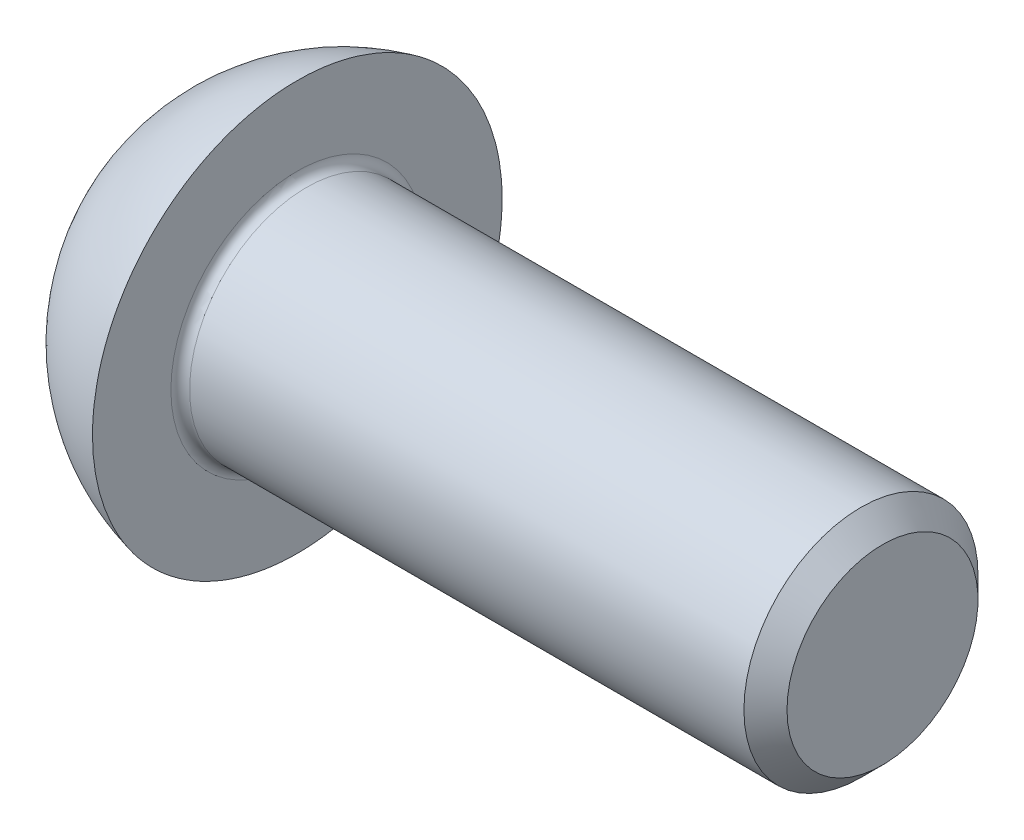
ISO-10303-21;
HEADER;
FILE_DESCRIPTION(('STEP AP214'),'2;1');
FILE_NAME('part.step','',(''),(''),'','','');
FILE_SCHEMA(('AUTOMOTIVE_DESIGN { 1 0 10303 214 1 1 1 1 }'));
ENDSEC;
DATA;
#1=APPLICATION_CONTEXT('core data for automotive mechanical design processes');
#2=APPLICATION_PROTOCOL_DEFINITION('international standard','automotive_design',2000,#1);
#3=PRODUCT_CONTEXT('',#1,'mechanical');
#4=PRODUCT('Part','Part','',(#3));
#5=PRODUCT_RELATED_PRODUCT_CATEGORY('part','',(#4));
#6=PRODUCT_DEFINITION_FORMATION('','',#4);
#7=PRODUCT_DEFINITION_CONTEXT('part definition',#1,'design');
#8=PRODUCT_DEFINITION('design','',#6,#7);
#9=PRODUCT_DEFINITION_SHAPE('','',#8);
#10=(LENGTH_UNIT() NAMED_UNIT(*) SI_UNIT(.MILLI.,.METRE.));
#11=(NAMED_UNIT(*) PLANE_ANGLE_UNIT() SI_UNIT($,.RADIAN.));
#12=(NAMED_UNIT(*) SI_UNIT($,.STERADIAN.) SOLID_ANGLE_UNIT());
#13=UNCERTAINTY_MEASURE_WITH_UNIT(LENGTH_MEASURE(1.E-05),#10,'distance_accuracy_value','');
#14=(GEOMETRIC_REPRESENTATION_CONTEXT(3) GLOBAL_UNCERTAINTY_ASSIGNED_CONTEXT((#13)) GLOBAL_UNIT_ASSIGNED_CONTEXT((#10,
#11,#12)) REPRESENTATION_CONTEXT('',''));
#15=CARTESIAN_POINT('',(0.,0.,0.));
#16=DIRECTION('',(0.,0.,1.));
#17=DIRECTION('',(1.,0.,0.));
#18=AXIS2_PLACEMENT_3D('',#15,#16,#17);
#19=CARTESIAN_POINT('',(-5.50000000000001,0.,4.23205080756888));
#20=DIRECTION('',(-1.,0.,0.));
#21=DIRECTION('',(0.,0.,1.));
#22=AXIS2_PLACEMENT_3D('',#19,#20,#21);
#23=PLANE('',#22);
#24=CARTESIAN_POINT('',(-5.50000000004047,0.,0.));
#25=DIRECTION('',(-1.,0.,0.));
#26=DIRECTION('',(0.,0.,1.));
#27=AXIS2_PLACEMENT_3D('',#24,#25,#26);
#28=CIRCLE('',#27,3.46410161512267);
#29=CARTESIAN_POINT('',(-5.5000000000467,1.73205080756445,-2.99999999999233));
#30=VERTEX_POINT('',#29);
#31=CARTESIAN_POINT('',(-5.5000000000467,3.4641016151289,0.));
#32=VERTEX_POINT('',#31);
#33=EDGE_CURVE('E82',#30,#32,#28,.F.);
#34=ORIENTED_EDGE('',*,*,#33,.T.);
#35=CARTESIAN_POINT('',(-5.50000000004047,0.,0.));
#36=DIRECTION('',(-1.,0.,0.));
#37=DIRECTION('',(0.,0.,1.));
#38=AXIS2_PLACEMENT_3D('',#35,#36,#37);
#39=CIRCLE('',#38,3.46410161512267);
#40=CARTESIAN_POINT('',(-5.500000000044,1.7320508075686,3.));
#41=VERTEX_POINT('',#40);
#42=EDGE_CURVE('E85',#32,#41,#39,.F.);
#43=ORIENTED_EDGE('',*,*,#42,.T.);
#44=CARTESIAN_POINT('',(-5.50000000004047,0.,-1.70530256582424E-10));
#45=DIRECTION('',(-1.,0.,0.));
#46=DIRECTION('',(0.,0.,1.));
#47=AXIS2_PLACEMENT_3D('',#44,#45,#46);
#48=CIRCLE('',#47,3.4641016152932);
#49=CARTESIAN_POINT('',(-5.50000000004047,-1.73205080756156,3.));
#50=VERTEX_POINT('',#49);
#51=EDGE_CURVE('E36',#50,#41,#48,.T.);
#52=ORIENTED_EDGE('',*,*,#51,.F.);
#53=CARTESIAN_POINT('',(-5.50000000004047,0.,0.));
#54=DIRECTION('',(-1.,0.,0.));
#55=DIRECTION('',(0.,0.,1.));
#56=AXIS2_PLACEMENT_3D('',#53,#54,#55);
#57=CIRCLE('',#56,3.46410161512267);
#58=CARTESIAN_POINT('',(-5.5000000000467,-3.4641016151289,0.));
#59=VERTEX_POINT('',#58);
#60=EDGE_CURVE('E97',#50,#59,#57,.F.);
#61=ORIENTED_EDGE('',*,*,#60,.T.);
#62=CARTESIAN_POINT('',(-5.50000000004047,0.,0.));
#63=DIRECTION('',(-1.,0.,0.));
#64=DIRECTION('',(0.,0.,1.));
#65=AXIS2_PLACEMENT_3D('',#62,#63,#64);
#66=CIRCLE('',#65,3.46410161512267);
#67=CARTESIAN_POINT('',(-5.5000000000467,-1.73205080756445,-2.99999999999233));
#68=VERTEX_POINT('',#67);
#69=EDGE_CURVE('E265',#59,#68,#66,.F.);
#70=ORIENTED_EDGE('',*,*,#69,.T.);
#71=CARTESIAN_POINT('',(-5.50000000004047,0.,0.));
#72=DIRECTION('',(-1.,0.,0.));
#73=DIRECTION('',(0.,0.,1.));
#74=AXIS2_PLACEMENT_3D('',#71,#72,#73);
#75=CIRCLE('',#74,3.46410161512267);
#76=EDGE_CURVE('E87',#68,#30,#75,.F.);
#77=ORIENTED_EDGE('',*,*,#76,.T.);
#78=EDGE_LOOP('',(#34,#43,#52,#61,#70,#77));
#79=FACE_BOUND('',#78,.T.);
#80=CARTESIAN_POINT('',(-5.50000000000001,0.,5.00000000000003));
#81=CARTESIAN_POINT('',(-5.50000000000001,-0.140476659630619,5.000001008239));
#82=CARTESIAN_POINT('',(-5.50000000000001,-0.280936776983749,4.9940774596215));
#83=CARTESIAN_POINT('',(-5.50000000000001,-0.560905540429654,4.97042461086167));
#84=CARTESIAN_POINT('',(-5.50000000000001,-0.700413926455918,4.95269220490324));
#85=CARTESIAN_POINT('',(-5.50000000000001,-0.977563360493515,4.90552225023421));
#86=CARTESIAN_POINT('',(-5.50000000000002,-1.11520263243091,4.87607427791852));
#87=CARTESIAN_POINT('',(-5.5,-1.38756018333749,4.80567031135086));
#88=CARTESIAN_POINT('',(-5.49999999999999,-1.52227737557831,4.76471011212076));
#89=CARTESIAN_POINT('',(-5.49999999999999,-1.78766636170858,4.67161716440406));
#90=CARTESIAN_POINT('',(-5.5,-1.91834147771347,4.61949388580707));
#91=CARTESIAN_POINT('',(-5.50000000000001,-2.17488396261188,4.50440360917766));
#92=CARTESIAN_POINT('',(-5.50000000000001,-2.30074954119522,4.44143262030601));
#93=CARTESIAN_POINT('',(-5.50000000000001,-2.5466504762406,4.30515031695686));
#94=CARTESIAN_POINT('',(-5.50000000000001,-2.66668938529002,4.23184541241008));
#95=CARTESIAN_POINT('',(-5.5,-2.90021046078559,4.07535785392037));
#96=CARTESIAN_POINT('',(-5.49999999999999,-3.01369019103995,3.99217156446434));
#97=CARTESIAN_POINT('',(-5.49999999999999,-3.23320892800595,3.81655761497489));
#98=CARTESIAN_POINT('',(-5.5,-3.33924989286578,3.72413240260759));
#99=CARTESIAN_POINT('',(-5.50000000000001,-3.54320821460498,3.53064329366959));
#100=CARTESIAN_POINT('',(-5.5,-3.64112255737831,3.4295762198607));
#101=CARTESIAN_POINT('',(-5.5,-3.82805666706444,3.21958626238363));
#102=CARTESIAN_POINT('',(-5.5,-3.91707935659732,3.11066598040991));
#103=CARTESIAN_POINT('',(-5.5,-4.08566537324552,2.88567263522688));
#104=CARTESIAN_POINT('',(-5.5,-4.1652251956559,2.76959694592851));
#105=CARTESIAN_POINT('',(-5.49999999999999,-4.31425248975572,2.53120093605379));
#106=CARTESIAN_POINT('',(-5.49999999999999,-4.38372386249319,2.4088830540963));
#107=CARTESIAN_POINT('',(-5.49999999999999,-4.5121410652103,2.15878453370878));
#108=CARTESIAN_POINT('',(-5.49999999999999,-4.57108299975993,2.03100189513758));
#109=CARTESIAN_POINT('',(-5.49999999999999,-4.67797059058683,1.77097228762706));
#110=CARTESIAN_POINT('',(-5.49999999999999,-4.72592031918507,1.63872699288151));
#111=CARTESIAN_POINT('',(-5.49999999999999,-4.81052688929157,1.37062088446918));
#112=CARTESIAN_POINT('',(-5.49999999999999,-4.84717955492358,1.23475875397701));
#113=CARTESIAN_POINT('',(-5.49999999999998,-4.90889410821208,0.960469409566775));
#114=CARTESIAN_POINT('',(-5.49999999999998,-4.93396024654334,0.822043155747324));
#115=CARTESIAN_POINT('',(-5.49999999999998,-4.97235753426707,0.54355856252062));
#116=CARTESIAN_POINT('',(-5.49999999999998,-4.98568434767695,0.403499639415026));
#117=CARTESIAN_POINT('',(-5.49999999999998,-5.00784149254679,-0.017529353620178));
#118=CARTESIAN_POINT('',(-5.49999999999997,-4.99891545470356,-0.299650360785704));
#119=CARTESIAN_POINT('',(-5.49999999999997,-4.93382336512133,-0.858235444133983));
#120=CARTESIAN_POINT('',(-5.49999999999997,-4.87765729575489,-1.13469951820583));
#121=CARTESIAN_POINT('',(-5.49999999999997,-4.71970864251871,-1.67431579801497));
#122=CARTESIAN_POINT('',(-5.49999999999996,-4.61792601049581,-1.93746798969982));
#123=CARTESIAN_POINT('',(-5.49999999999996,-4.37162574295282,-2.44293830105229));
#124=CARTESIAN_POINT('',(-5.49999999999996,-4.22710812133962,-2.68525642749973));
#125=CARTESIAN_POINT('',(-5.49999999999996,-3.8994424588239,-3.1421937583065));
#126=CARTESIAN_POINT('',(-5.49999999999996,-3.71629443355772,-3.35681297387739));
#127=CARTESIAN_POINT('',(-5.49999999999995,-3.31656637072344,-3.75225650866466));
#128=CARTESIAN_POINT('',(-5.49999999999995,-3.09998632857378,-3.93308082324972));
#129=CARTESIAN_POINT('',(-5.49999999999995,-2.6395424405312,-4.25580246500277));
#130=CARTESIAN_POINT('',(-5.49999999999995,-2.39567859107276,-4.39769978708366));
#131=CARTESIAN_POINT('',(-5.49999999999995,-1.8875896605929,-4.63853909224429));
#132=CARTESIAN_POINT('',(-5.49999999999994,-1.62336458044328,-4.73748107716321));
#133=CARTESIAN_POINT('',(-5.49999999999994,-1.0820537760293,-4.88960111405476));
#134=CARTESIAN_POINT('',(-5.49999999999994,-0.80496805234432,-4.9427791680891));
#135=CARTESIAN_POINT('',(-5.49999999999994,-0.245801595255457,-5.00186175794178));
#136=CARTESIAN_POINT('',(-5.49999999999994,0.0362791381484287,-5.00776629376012));
#137=CARTESIAN_POINT('',(-5.49999999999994,0.597428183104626,-4.97213425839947));
#138=CARTESIAN_POINT('',(-5.49999999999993,0.876496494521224,-4.9305976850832));
#139=CARTESIAN_POINT('',(-5.49999999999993,1.42369876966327,-4.80126245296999));
#140=CARTESIAN_POINT('',(-5.49999999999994,1.69183273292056,-4.71346379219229));
#141=CARTESIAN_POINT('',(-5.49999999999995,2.20955471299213,-4.49409701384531));
#142=CARTESIAN_POINT('',(-5.49999999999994,2.45914273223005,-4.36252890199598));
#143=CARTESIAN_POINT('',(-5.49999999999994,2.93268782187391,-4.05935706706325));
#144=CARTESIAN_POINT('',(-5.49999999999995,3.15664489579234,-3.8877533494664));
#145=CARTESIAN_POINT('',(-5.49999999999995,3.57257051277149,-3.5093852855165));
#146=CARTESIAN_POINT('',(-5.49999999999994,3.76453904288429,-3.30262092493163));
#147=CARTESIAN_POINT('',(-5.49999999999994,4.11103893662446,-2.85978700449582));
#148=CARTESIAN_POINT('',(-5.49999999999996,4.26557028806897,-2.62371743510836));
#149=CARTESIAN_POINT('',(-5.49999999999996,4.5328057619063,-2.1290269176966));
#150=CARTESIAN_POINT('',(-5.49999999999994,4.64550992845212,-1.87040599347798));
#151=CARTESIAN_POINT('',(-5.49999999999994,4.82590362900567,-1.33775940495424));
#152=CARTESIAN_POINT('',(-5.49999999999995,4.89359317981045,-1.06373374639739));
#153=CARTESIAN_POINT('',(-5.49999999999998,4.95991639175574,-0.647371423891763));
#154=CARTESIAN_POINT('',(-5.49999999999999,4.97615485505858,-0.507620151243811));
#155=CARTESIAN_POINT('',(-5.49999999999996,4.99680611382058,-0.227260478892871));
#156=CARTESIAN_POINT('',(-5.49999999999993,5.00122327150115,-0.0866524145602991));
#157=CARTESIAN_POINT('',(-5.49999999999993,4.99819539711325,0.194477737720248));
#158=CARTESIAN_POINT('',(-5.49999999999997,4.99074600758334,0.334999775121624));
#159=CARTESIAN_POINT('',(-5.49999999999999,4.96403938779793,0.614867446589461));
#160=CARTESIAN_POINT('',(-5.49999999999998,4.94478651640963,0.754213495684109));
#161=CARTESIAN_POINT('',(-5.49999999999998,4.89460298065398,1.03083953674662));
#162=CARTESIAN_POINT('',(-5.5,4.86366798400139,1.16811874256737));
#163=CARTESIAN_POINT('',(-5.49999999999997,4.79035475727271,1.43953248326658));
#164=CARTESIAN_POINT('',(-5.49999999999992,4.747980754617,1.57366816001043));
#165=CARTESIAN_POINT('',(-5.49999999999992,4.65206684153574,1.83794512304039));
#166=CARTESIAN_POINT('',(-5.49999999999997,4.59852260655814,1.96808483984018));
#167=CARTESIAN_POINT('',(-5.50000000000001,4.48068084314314,2.22334268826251));
#168=CARTESIAN_POINT('',(-5.49999999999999,4.41638729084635,2.34846265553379));
#169=CARTESIAN_POINT('',(-5.49999999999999,4.27746703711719,2.59288300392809));
#170=CARTESIAN_POINT('',(-5.50000000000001,4.20283693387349,2.7121814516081));
#171=CARTESIAN_POINT('',(-5.49999999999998,4.0438198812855,2.94402322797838));
#172=CARTESIAN_POINT('',(-5.49999999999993,3.95943654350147,3.05656903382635));
#173=CARTESIAN_POINT('',(-5.49999999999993,3.78146694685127,3.27418235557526));
#174=CARTESIAN_POINT('',(-5.49999999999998,3.68787826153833,3.37924788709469));
#175=CARTESIAN_POINT('',(-5.50000000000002,3.49221829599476,3.58108352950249));
#176=CARTESIAN_POINT('',(-5.5,3.39015015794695,3.6778566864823));
#177=CARTESIAN_POINT('',(-5.5,3.17816100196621,3.86252052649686));
#178=CARTESIAN_POINT('',(-5.50000000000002,3.06823517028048,3.95040568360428));
#179=CARTESIAN_POINT('',(-5.49999999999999,2.84141052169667,4.11656944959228));
#180=CARTESIAN_POINT('',(-5.49999999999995,2.72451428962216,4.19485158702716));
#181=CARTESIAN_POINT('',(-5.49999999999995,2.48444125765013,4.34135261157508));
#182=CARTESIAN_POINT('',(-5.49999999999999,2.36125922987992,4.40956293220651));
#183=CARTESIAN_POINT('',(-5.50000000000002,2.10962973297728,4.53533236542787));
#184=CARTESIAN_POINT('',(-5.50000000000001,1.98118420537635,4.59289536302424));
#185=CARTESIAN_POINT('',(-5.50000000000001,1.72001295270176,4.69694530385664));
#186=CARTESIAN_POINT('',(-5.50000000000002,1.587291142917,4.74344206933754));
#187=CARTESIAN_POINT('',(-5.5,1.31844796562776,4.82508343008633));
#188=CARTESIAN_POINT('',(-5.49999999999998,1.18232750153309,4.8602310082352));
#189=CARTESIAN_POINT('',(-5.49999999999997,0.873391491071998,4.92625132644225));
#190=CARTESIAN_POINT('',(-5.5,0.699873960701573,4.95388360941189));
#191=CARTESIAN_POINT('',(-5.50000000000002,0.350895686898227,4.99075731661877));
#192=CARTESIAN_POINT('',(-5.50000000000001,0.175434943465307,4.999998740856));
#193=CARTESIAN_POINT('',(-5.50000000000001,0.,5.00000000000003));
#194=B_SPLINE_CURVE_WITH_KNOTS('',3,(#80,#81,#82,#83,#84,#85,#86,#87,#88,#89,#90,#91,#92,#93,
#94,#95,#96,#97,#98,#99,#100,#101,#102,#103,#104,#105,#106,#107,#108,#109,#110,#111,#112,#113,
#114,#115,#116,#117,#118,#119,#120,#121,#122,#123,#124,#125,#126,#127,#128,#129,#130,#131,#132,
#133,#134,#135,#136,#137,#138,#139,#140,#141,#142,#143,#144,#145,#146,#147,#148,#149,#150,#151,
#152,#153,#154,#155,#156,#157,#158,#159,#160,#161,#162,#163,#164,#165,#166,#167,#168,#169,#170,
#171,#172,#173,#174,#175,#176,#177,#178,#179,#180,#181,#182,#183,#184,#185,#186,#187,#188,#189,
#190,#191,#192,#193),.UNSPECIFIED.,.T.,.F.,(4,2,2,2,2,2,2,2,2,2,2,2,2,2,2,2,2,2,2,2,2,2,2,2,2,2,
2,2,2,2,2,2,2,2,2,2,2,2,2,2,2,2,2,2,2,2,2,2,2,2,2,2,2,2,2,2,4),(0.,0.421276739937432,
0.842664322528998,1.26442766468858,1.68634526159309,2.10790634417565,2.52962285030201,
2.95107891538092,3.37269052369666,3.79419072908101,4.21584657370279,4.6373633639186,
5.05903578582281,5.4805447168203,5.9022092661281,6.32371734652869,6.74538104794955,
7.1668899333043,7.58855444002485,8.43097667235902,9.2733992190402,10.1158226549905,
10.9582458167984,11.8006686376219,12.6430915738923,13.4855146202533,14.327937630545,
15.1703606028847,16.0127835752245,16.8552065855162,17.6976296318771,18.5400525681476,
19.3824753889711,20.224898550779,21.0673219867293,21.9097445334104,22.7521667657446,
23.1738312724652,23.5953401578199,24.0170038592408,24.4385119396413,24.8601764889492,
25.2816854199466,25.7033578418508,26.1248746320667,26.5465304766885,26.9680306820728,
27.3896422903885,27.8110983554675,28.2328148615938,28.6543759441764,29.0762935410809,
29.4980568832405,29.9194444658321,30.3407212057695,30.8668346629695,31.3929481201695),.UNSPECIFIED.);
#195=CARTESIAN_POINT('',(-5.50000000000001,0.,5.00000000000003));
#196=VERTEX_POINT('',#195);
#197=EDGE_CURVE('E105',#196,#196,#194,.T.);
#198=ORIENTED_EDGE('',*,*,#197,.F.);
#199=EDGE_LOOP('',(#198));
#200=FACE_BOUND('',#199,.T.);
#201=ADVANCED_FACE('F32',(#79,#200),#23,.T.);
#202=CARTESIAN_POINT('',(-5.03311146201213,0.,0.));
#203=DIRECTION('',(-1.,0.,0.));
#204=DIRECTION('',(0.,0.,1.));
#205=AXIS2_PLACEMENT_3D('',#202,#203,#204);
#206=CONICAL_SURFACE('',#205,2.99721307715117,0.785398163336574);
#207=CARTESIAN_POINT('',(-5.5000000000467,1.73205080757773,-2.99999999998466));
#208=CARTESIAN_POINT('',(-5.44052569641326,1.79158223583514,-2.8968885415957));
#209=CARTESIAN_POINT('',(-5.3845449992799,1.85210903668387,-2.79205304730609));
#210=CARTESIAN_POINT('',(-5.28204673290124,1.97552939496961,-2.57828271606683));
#211=CARTESIAN_POINT('',(-5.23558617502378,2.0384346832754,-2.46932756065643));
#212=CARTESIAN_POINT('',(-5.1559989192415,2.1652800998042,-2.24962485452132));
#213=CARTESIAN_POINT('',(-5.12267223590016,2.22918794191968,-2.13893322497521));
#214=CARTESIAN_POINT('',(-5.07132616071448,2.35841021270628,-1.9151136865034));
#215=CARTESIAN_POINT('',(-5.05326845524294,2.42372069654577,-1.8019926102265));
#216=CARTESIAN_POINT('',(-5.03697523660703,2.53628617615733,-1.60702348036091));
#217=CARTESIAN_POINT('',(-5.03456399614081,2.58339589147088,-1.52542705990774));
#218=CARTESIAN_POINT('',(-5.03863151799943,2.67753863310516,-1.36236704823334));
#219=CARTESIAN_POINT('',(-5.04511339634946,2.72457162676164,-1.28090351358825));
#220=CARTESIAN_POINT('',(-5.06659704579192,2.81819196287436,-1.11874833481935));
#221=CARTESIAN_POINT('',(-5.08160834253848,2.86477874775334,-1.03805765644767));
#222=CARTESIAN_POINT('',(-5.11933151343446,2.95715218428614,-0.878062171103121));
#223=CARTESIAN_POINT('',(-5.14204279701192,3.00293889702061,-0.798757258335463));
#224=CARTESIAN_POINT('',(-5.18876371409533,3.08421278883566,-0.657986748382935));
#225=CARTESIAN_POINT('',(-5.21154386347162,3.11988007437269,-0.596209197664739));
#226=CARTESIAN_POINT('',(-5.26077453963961,3.19057450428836,-0.473762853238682));
#227=CARTESIAN_POINT('',(-5.28722517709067,3.22560162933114,-0.413094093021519));
#228=CARTESIAN_POINT('',(-5.34320408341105,3.29490536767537,-0.293056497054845));
#229=CARTESIAN_POINT('',(-5.37272267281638,3.32918395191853,-0.233684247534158));
#230=CARTESIAN_POINT('',(-5.43445005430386,3.39710647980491,-0.116038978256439));
#231=CARTESIAN_POINT('',(-5.46665719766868,3.43075079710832,-0.0577653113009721));
#232=CARTESIAN_POINT('',(-5.5000000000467,3.4641016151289,-1.53371779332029E-11));
#233=B_SPLINE_CURVE_WITH_KNOTS('',3,(#207,#208,#209,#210,#211,#212,#213,#214,#215,#216,#217,
#218,#219,#220,#221,#222,#223,#224,#225,#226,#227,#228,#229,#230,#231,#232),.UNSPECIFIED.,.F.,
.F.,(4,2,2,2,2,2,2,2,2,2,2,2,4),(0.,0.399548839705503,0.801424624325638,1.19691998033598,
1.59141997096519,1.87377108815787,2.15622116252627,2.43898729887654,2.72173175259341,
2.94627735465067,3.1708297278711,3.39469398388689,3.61842195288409),.UNSPECIFIED.);
#234=EDGE_CURVE('E99',#30,#32,#233,.T.);
#235=ORIENTED_EDGE('',*,*,#234,.T.);
#236=ORIENTED_EDGE('',*,*,#33,.F.);
#237=EDGE_LOOP('',(#235,#236));
#238=FACE_BOUND('',#237,.T.);
#239=ADVANCED_FACE('F100',(#238),#206,.F.);
#240=CARTESIAN_POINT('',(-5.03311146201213,0.,0.));
#241=DIRECTION('',(-1.,0.,0.));
#242=DIRECTION('',(0.,0.,1.));
#243=AXIS2_PLACEMENT_3D('',#240,#241,#242);
#244=CONICAL_SURFACE('',#243,2.99721307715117,0.785398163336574);
#245=CARTESIAN_POINT('',(-5.5000000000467,3.4641016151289,1.53378940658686E-11));
#246=CARTESIAN_POINT('',(-5.44052569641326,3.4045701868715,0.103111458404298));
#247=CARTESIAN_POINT('',(-5.3845449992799,3.34404338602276,0.207946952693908));
#248=CARTESIAN_POINT('',(-5.28204673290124,3.22062302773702,0.421717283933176));
#249=CARTESIAN_POINT('',(-5.23558617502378,3.15771773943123,0.53067243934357));
#250=CARTESIAN_POINT('',(-5.1559989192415,3.03087232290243,0.750375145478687));
#251=CARTESIAN_POINT('',(-5.12267223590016,2.96696448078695,0.861066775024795));
#252=CARTESIAN_POINT('',(-5.07132616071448,2.83774221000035,1.0848863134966));
#253=CARTESIAN_POINT('',(-5.05326845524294,2.77243172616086,1.1980073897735));
#254=CARTESIAN_POINT('',(-5.03697523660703,2.6598662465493,1.39297651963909));
#255=CARTESIAN_POINT('',(-5.03456399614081,2.61275653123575,1.47457294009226));
#256=CARTESIAN_POINT('',(-5.03863151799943,2.51861378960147,1.63763295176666));
#257=CARTESIAN_POINT('',(-5.04511339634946,2.47158079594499,1.71909648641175));
#258=CARTESIAN_POINT('',(-5.06659704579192,2.37796045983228,1.88125166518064));
#259=CARTESIAN_POINT('',(-5.08160834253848,2.33137367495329,1.96194234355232));
#260=CARTESIAN_POINT('',(-5.11933151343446,2.23900023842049,2.12193782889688));
#261=CARTESIAN_POINT('',(-5.14204279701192,2.19321352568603,2.20124274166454));
#262=CARTESIAN_POINT('',(-5.18876371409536,2.11193963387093,2.34201325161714));
#263=CARTESIAN_POINT('',(-5.21154386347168,2.07627234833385,2.40379080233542));
#264=CARTESIAN_POINT('',(-5.26077453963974,2.0055779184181,2.52623714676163));
#265=CARTESIAN_POINT('',(-5.28722517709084,1.97055079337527,2.58690590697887));
#266=CARTESIAN_POINT('',(-5.3432040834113,1.90124705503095,2.70694350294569));
#267=CARTESIAN_POINT('',(-5.37272267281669,1.86696847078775,2.76631575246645));
#268=CARTESIAN_POINT('',(-5.43445005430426,1.79904594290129,2.88396102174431));
#269=CARTESIAN_POINT('',(-5.46665719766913,1.76540162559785,2.94223468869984));
#270=CARTESIAN_POINT('',(-5.50000000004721,1.73205080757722,2.99999999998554));
#271=B_SPLINE_CURVE_WITH_KNOTS('',3,(#245,#246,#247,#248,#249,#250,#251,#252,#253,#254,#255,
#256,#257,#258,#259,#260,#261,#262,#263,#264,#265,#266,#267,#268,#269,#270),.UNSPECIFIED.,.F.,
.F.,(4,2,2,2,2,2,2,2,2,2,2,2,4),(0.,0.399548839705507,0.801424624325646,1.19691998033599,
1.5914199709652,1.87377108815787,2.15622116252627,2.43898729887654,2.72173175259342,
2.94627735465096,3.17082972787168,3.39469398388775,3.61842195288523),.UNSPECIFIED.);
#272=EDGE_CURVE('E96',#32,#41,#271,.T.);
#273=ORIENTED_EDGE('',*,*,#272,.T.);
#274=ORIENTED_EDGE('',*,*,#42,.F.);
#275=EDGE_LOOP('',(#273,#274));
#276=FACE_BOUND('',#275,.T.);
#277=ADVANCED_FACE('F94',(#276),#244,.F.);
#278=CARTESIAN_POINT('',(-5.5,-1.73205080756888,3.));
#279=DIRECTION('',(0.,0.,1.));
#280=DIRECTION('',(1.,0.,0.));
#281=AXIS2_PLACEMENT_3D('',#278,#279,#280);
#282=PLANE('',#281);
#283=DIRECTION('',(1.,0.,0.));
#284=VECTOR('',#283,1.);
#285=CARTESIAN_POINT('',(-5.5,1.73205080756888,3.));
#286=LINE('',#285,#284);
#287=CARTESIAN_POINT('',(-2.38,1.73205080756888,3.));
#288=VERTEX_POINT('',#287);
#289=EDGE_CURVE('E113',#41,#288,#286,.T.);
#290=ORIENTED_EDGE('',*,*,#289,.T.);
#291=DIRECTION('',(0.,1.,0.));
#292=VECTOR('',#291,1.);
#293=CARTESIAN_POINT('',(-2.38,-1.73205080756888,3.));
#294=LINE('',#293,#292);
#295=CARTESIAN_POINT('',(-2.38,-1.73205080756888,3.));
#296=VERTEX_POINT('',#295);
#297=EDGE_CURVE('E124',#296,#288,#294,.T.);
#298=ORIENTED_EDGE('',*,*,#297,.F.);
#299=DIRECTION('',(1.,0.,0.));
#300=VECTOR('',#299,1.);
#301=CARTESIAN_POINT('',(-5.5,-1.73205080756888,3.));
#302=LINE('',#301,#300);
#303=EDGE_CURVE('E119',#296,#50,#302,.F.);
#304=ORIENTED_EDGE('',*,*,#303,.T.);
#305=CARTESIAN_POINT('',(-5.50000000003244,1.73205080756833,3.));
#306=CARTESIAN_POINT('',(-5.44052569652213,1.61298795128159,3.));
#307=CARTESIAN_POINT('',(-5.38454499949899,1.49193434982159,3.));
#308=CARTESIAN_POINT('',(-5.28204673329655,1.24509363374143,3.));
#309=CARTESIAN_POINT('',(-5.23558617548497,1.11928305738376,3.));
#310=CARTESIAN_POINT('',(-5.15599891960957,0.865592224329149,3.));
#311=CARTESIAN_POINT('',(-5.12267223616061,0.737776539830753,3.));
#312=CARTESIAN_POINT('',(-5.07132616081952,0.479331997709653,3.));
#313=CARTESIAN_POINT('',(-5.05326845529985,0.348711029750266,3.));
#314=CARTESIAN_POINT('',(-5.03697523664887,0.12358007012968,3.));
#315=CARTESIAN_POINT('',(-5.03456399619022,0.029360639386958,3.));
#316=CARTESIAN_POINT('',(-5.0386315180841,-0.158924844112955,3.));
#317=CARTESIAN_POINT('',(-5.04511339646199,-0.252990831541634,3.));
#318=CARTESIAN_POINT('',(-5.06659704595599,-0.440231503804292,3.));
#319=CARTESIAN_POINT('',(-5.08160834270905,-0.53340507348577,3.));
#320=CARTESIAN_POINT('',(-5.1193315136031,-0.718151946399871,3.));
#321=CARTESIAN_POINT('',(-5.14204279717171,-0.809725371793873,3.));
#322=CARTESIAN_POINT('',(-5.18876370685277,-0.972273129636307,3.));
#323=CARTESIAN_POINT('',(-5.21154384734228,-1.04360767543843,3.));
#324=CARTESIAN_POINT('',(-5.26077450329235,-1.18499648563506,3.));
#325=CARTESIAN_POINT('',(-5.28722512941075,-1.25505071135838,3.));
#326=CARTESIAN_POINT('',(-5.34320401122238,-1.39365814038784,3.));
#327=CARTESIAN_POINT('',(-5.37272258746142,-1.46221528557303,3.));
#328=CARTESIAN_POINT('',(-5.43444994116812,-1.59806029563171,3.));
#329=CARTESIAN_POINT('',(-5.46665706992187,-1.66534890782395,3.));
#330=CARTESIAN_POINT('',(-5.49999985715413,-1.73205052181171,3.));
#331=B_SPLINE_CURVE_WITH_KNOTS('',3,(#305,#306,#307,#308,#309,#310,#311,#312,#313,#314,#315,
#316,#317,#318,#319,#320,#321,#322,#323,#324,#325,#326,#327,#328,#329,#330),.UNSPECIFIED.,.F.,
.F.,(4,2,2,2,2,2,2,2,2,2,2,2,4),(0.,0.399548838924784,0.80142462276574,1.19691997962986,
1.59141997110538,1.87377108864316,2.15622116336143,2.43898729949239,2.72173175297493,
2.94627727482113,3.17082956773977,3.39469374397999,3.61842163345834),.UNSPECIFIED.);
#332=EDGE_CURVE('E11',#41,#50,#331,.T.);
#333=ORIENTED_EDGE('',*,*,#332,.F.);
#334=EDGE_LOOP('',(#290,#298,#304,#333));
#335=FACE_BOUND('',#334,.T.);
#336=ADVANCED_FACE('F237',(#335),#282,.F.);
#337=CARTESIAN_POINT('',(-5.5,1.73205080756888,3.));
#338=DIRECTION('',(0.,0.866025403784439,0.5));
#339=DIRECTION('',(0.,-0.5,0.866025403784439));
#340=AXIS2_PLACEMENT_3D('',#337,#338,#339);
#341=PLANE('',#340);
#342=DIRECTION('',(1.,0.,0.));
#343=VECTOR('',#342,1.);
#344=CARTESIAN_POINT('',(-5.5,3.46410161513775,0.));
#345=LINE('',#344,#343);
#346=CARTESIAN_POINT('',(-2.38,3.46410161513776,0.));
#347=VERTEX_POINT('',#346);
#348=EDGE_CURVE('E111',#347,#32,#345,.F.);
#349=ORIENTED_EDGE('',*,*,#348,.F.);
#350=DIRECTION('',(0.,-0.5,0.866025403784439));
#351=VECTOR('',#350,1.);
#352=CARTESIAN_POINT('',(-2.38,1.73205080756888,3.));
#353=LINE('',#352,#351);
#354=EDGE_CURVE('E118',#288,#347,#353,.F.);
#355=ORIENTED_EDGE('',*,*,#354,.F.);
#356=ORIENTED_EDGE('',*,*,#289,.F.);
#357=ORIENTED_EDGE('',*,*,#272,.F.);
#358=EDGE_LOOP('',(#349,#355,#356,#357));
#359=FACE_BOUND('',#358,.T.);
#360=ADVANCED_FACE('F109',(#359),#341,.F.);
#361=CARTESIAN_POINT('',(-2.38,0.,1.45));
#362=DIRECTION('',(-1.,0.,0.));
#363=DIRECTION('',(0.,0.,1.));
#364=AXIS2_PLACEMENT_3D('',#361,#362,#363);
#365=PLANE('',#364);
#366=DIRECTION('',(0.,-0.5,-0.866025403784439));
#367=VECTOR('',#366,1.);
#368=CARTESIAN_POINT('',(-2.38,-3.46410161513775,0.));
#369=LINE('',#368,#367);
#370=CARTESIAN_POINT('',(-2.38,-3.46410161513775,0.));
#371=VERTEX_POINT('',#370);
#372=EDGE_CURVE('E121',#371,#296,#369,.F.);
#373=ORIENTED_EDGE('',*,*,#372,.T.);
#374=ORIENTED_EDGE('',*,*,#297,.T.);
#375=ORIENTED_EDGE('',*,*,#354,.T.);
#376=DIRECTION('',(0.,0.5,0.866025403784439));
#377=VECTOR('',#376,1.);
#378=CARTESIAN_POINT('',(-2.38,3.46410161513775,0.));
#379=LINE('',#378,#377);
#380=CARTESIAN_POINT('',(-2.38,1.73205080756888,-3.));
#381=VERTEX_POINT('',#380);
#382=EDGE_CURVE('E117',#347,#381,#379,.F.);
#383=ORIENTED_EDGE('',*,*,#382,.T.);
#384=DIRECTION('',(0.,1.,0.));
#385=VECTOR('',#384,1.);
#386=CARTESIAN_POINT('',(-2.38,1.73205080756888,-3.));
#387=LINE('',#386,#385);
#388=CARTESIAN_POINT('',(-2.38,-1.73205080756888,-3.));
#389=VERTEX_POINT('',#388);
#390=EDGE_CURVE('E131',#381,#389,#387,.F.);
#391=ORIENTED_EDGE('',*,*,#390,.T.);
#392=DIRECTION('',(0.,0.5,-0.866025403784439));
#393=VECTOR('',#392,1.);
#394=CARTESIAN_POINT('',(-2.38,-1.73205080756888,-3.));
#395=LINE('',#394,#393);
#396=EDGE_CURVE('E133',#389,#371,#395,.F.);
#397=ORIENTED_EDGE('',*,*,#396,.T.);
#398=EDGE_LOOP('',(#373,#374,#375,#383,#391,#397));
#399=FACE_BOUND('',#398,.T.);
#400=ADVANCED_FACE('F376',(#399),#365,.T.);
#401=CARTESIAN_POINT('',(-5.5,-3.46410161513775,0.));
#402=DIRECTION('',(0.,-0.866025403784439,0.5));
#403=DIRECTION('',(0.,-0.5,-0.866025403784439));
#404=AXIS2_PLACEMENT_3D('',#401,#402,#403);
#405=PLANE('',#404);
#406=ORIENTED_EDGE('',*,*,#303,.F.);
#407=ORIENTED_EDGE('',*,*,#372,.F.);
#408=DIRECTION('',(1.,0.,0.));
#409=VECTOR('',#408,1.);
#410=CARTESIAN_POINT('',(-5.5,-3.46410161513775,0.));
#411=LINE('',#410,#409);
#412=EDGE_CURVE('E136',#371,#59,#411,.F.);
#413=ORIENTED_EDGE('',*,*,#412,.T.);
#414=CARTESIAN_POINT('',(-5.50000000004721,-1.73205080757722,2.99999999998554));
#415=CARTESIAN_POINT('',(-5.44052569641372,-1.79158223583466,2.89688854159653));
#416=CARTESIAN_POINT('',(-5.38454499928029,-1.85210903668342,2.79205304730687));
#417=CARTESIAN_POINT('',(-5.28204673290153,-1.97552939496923,2.57828271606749));
#418=CARTESIAN_POINT('',(-5.23558617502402,-2.03843468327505,2.46932756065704));
#419=CARTESIAN_POINT('',(-5.15599891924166,-2.16528009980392,2.2496248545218));
#420=CARTESIAN_POINT('',(-5.12267223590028,-2.22918794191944,2.13893322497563));
#421=CARTESIAN_POINT('',(-5.07132616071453,-2.35841021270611,1.91511368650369));
#422=CARTESIAN_POINT('',(-5.05326845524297,-2.42372069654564,1.80199261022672));
#423=CARTESIAN_POINT('',(-5.03697523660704,-2.53628617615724,1.60702348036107));
#424=CARTESIAN_POINT('',(-5.03456399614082,-2.58339589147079,1.5254270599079));
#425=CARTESIAN_POINT('',(-5.03863151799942,-2.67753863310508,1.36236704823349));
#426=CARTESIAN_POINT('',(-5.04511339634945,-2.72457162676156,1.2809035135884));
#427=CARTESIAN_POINT('',(-5.0665970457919,-2.81819196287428,1.11874833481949));
#428=CARTESIAN_POINT('',(-5.08160834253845,-2.86477874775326,1.03805765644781));
#429=CARTESIAN_POINT('',(-5.11933151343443,-2.95715218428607,0.878062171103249));
#430=CARTESIAN_POINT('',(-5.14204279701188,-3.00293889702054,0.798757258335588));
#431=CARTESIAN_POINT('',(-5.18876371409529,-3.0842127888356,0.657986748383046));
#432=CARTESIAN_POINT('',(-5.21154386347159,-3.11988007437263,0.596209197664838));
#433=CARTESIAN_POINT('',(-5.26077453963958,-3.19057450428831,0.473762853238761));
#434=CARTESIAN_POINT('',(-5.28722517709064,-3.2256016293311,0.413094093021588));
#435=CARTESIAN_POINT('',(-5.34320408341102,-3.29490536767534,0.293056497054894));
#436=CARTESIAN_POINT('',(-5.37272267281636,-3.32918395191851,0.233684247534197));
#437=CARTESIAN_POINT('',(-5.43445005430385,-3.3971064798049,0.116038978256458));
#438=CARTESIAN_POINT('',(-5.46665719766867,-3.43075079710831,0.0577653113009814));
#439=CARTESIAN_POINT('',(-5.5000000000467,-3.4641016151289,1.53371898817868E-11));
#440=B_SPLINE_CURVE_WITH_KNOTS('',3,(#414,#415,#416,#417,#418,#419,#420,#421,#422,#423,#424,
#425,#426,#427,#428,#429,#430,#431,#432,#433,#434,#435,#436,#437,#438,#439),.UNSPECIFIED.,.F.,
.F.,(4,2,2,2,2,2,2,2,2,2,2,2,4),(0.,0.399548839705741,0.801424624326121,1.1969199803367,
1.59141997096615,1.87377108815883,2.15622116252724,2.43898729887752,2.72173175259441,
2.9462773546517,3.17082972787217,3.39469398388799,3.61842195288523),.UNSPECIFIED.);
#441=EDGE_CURVE('E139',#50,#59,#440,.T.);
#442=ORIENTED_EDGE('',*,*,#441,.F.);
#443=EDGE_LOOP('',(#406,#407,#413,#442));
#444=FACE_BOUND('',#443,.T.);
#445=ADVANCED_FACE('F367',(#444),#405,.F.);
#446=CARTESIAN_POINT('',(-5.03311146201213,0.,0.));
#447=DIRECTION('',(-1.,0.,0.));
#448=DIRECTION('',(0.,0.,1.));
#449=AXIS2_PLACEMENT_3D('',#446,#447,#448);
#450=CONICAL_SURFACE('',#449,2.99721307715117,0.785398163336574);
#451=ORIENTED_EDGE('',*,*,#441,.T.);
#452=ORIENTED_EDGE('',*,*,#60,.F.);
#453=EDGE_LOOP('',(#451,#452));
#454=FACE_BOUND('',#453,.T.);
#455=ADVANCED_FACE('F163',(#454),#450,.F.);
#456=CARTESIAN_POINT('',(-5.03311146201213,0.,0.));
#457=DIRECTION('',(-1.,0.,0.));
#458=DIRECTION('',(0.,0.,1.));
#459=AXIS2_PLACEMENT_3D('',#456,#457,#458);
#460=CONICAL_SURFACE('',#459,2.99721307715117,0.785398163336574);
#461=CARTESIAN_POINT('',(-5.5000000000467,-3.4641016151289,-1.53381075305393E-11));
#462=CARTESIAN_POINT('',(-5.44052569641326,-3.4045701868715,-0.103111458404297));
#463=CARTESIAN_POINT('',(-5.3845449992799,-3.34404338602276,-0.207946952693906));
#464=CARTESIAN_POINT('',(-5.28204673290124,-3.22062302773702,-0.421717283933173));
#465=CARTESIAN_POINT('',(-5.23558617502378,-3.15771773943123,-0.530672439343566));
#466=CARTESIAN_POINT('',(-5.1559989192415,-3.03087232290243,-0.750375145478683));
#467=CARTESIAN_POINT('',(-5.12267223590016,-2.96696448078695,-0.861066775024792));
#468=CARTESIAN_POINT('',(-5.07132616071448,-2.83774221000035,-1.0848863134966));
#469=CARTESIAN_POINT('',(-5.05326845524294,-2.77243172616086,-1.1980073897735));
#470=CARTESIAN_POINT('',(-5.03697523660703,-2.6598662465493,-1.39297651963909));
#471=CARTESIAN_POINT('',(-5.03456399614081,-2.61275653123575,-1.47457294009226));
#472=CARTESIAN_POINT('',(-5.03863151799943,-2.51861378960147,-1.63763295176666));
#473=CARTESIAN_POINT('',(-5.04511339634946,-2.47158079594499,-1.71909648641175));
#474=CARTESIAN_POINT('',(-5.06659704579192,-2.37796045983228,-1.88125166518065));
#475=CARTESIAN_POINT('',(-5.08160834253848,-2.33137367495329,-1.96194234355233));
#476=CARTESIAN_POINT('',(-5.11933151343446,-2.23900023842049,-2.12193782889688));
#477=CARTESIAN_POINT('',(-5.14204279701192,-2.19321352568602,-2.20124274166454));
#478=CARTESIAN_POINT('',(-5.18876371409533,-2.11193963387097,-2.34201325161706));
#479=CARTESIAN_POINT('',(-5.21154386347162,-2.07627234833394,-2.40379080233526));
#480=CARTESIAN_POINT('',(-5.26077453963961,-2.00557791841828,-2.52623714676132));
#481=CARTESIAN_POINT('',(-5.28722517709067,-1.9705507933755,-2.58690590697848));
#482=CARTESIAN_POINT('',(-5.34320408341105,-1.90124705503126,-2.70694350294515));
#483=CARTESIAN_POINT('',(-5.37272267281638,-1.8669684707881,-2.76631575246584));
#484=CARTESIAN_POINT('',(-5.43445005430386,-1.79904594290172,-2.88396102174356));
#485=CARTESIAN_POINT('',(-5.46665719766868,-1.76540162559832,-2.94223468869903));
#486=CARTESIAN_POINT('',(-5.5000000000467,-1.73205080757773,-2.99999999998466));
#487=B_SPLINE_CURVE_WITH_KNOTS('',3,(#461,#462,#463,#464,#465,#466,#467,#468,#469,#470,#471,
#472,#473,#474,#475,#476,#477,#478,#479,#480,#481,#482,#483,#484,#485,#486),.UNSPECIFIED.,.F.,
.F.,(4,2,2,2,2,2,2,2,2,2,2,2,4),(0.,0.399548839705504,0.80142462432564,1.19691998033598,
1.5914199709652,1.87377108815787,2.15622116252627,2.43898729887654,2.72173175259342,
2.94627735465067,3.17082972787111,3.39469398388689,3.6184219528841),.UNSPECIFIED.);
#488=EDGE_CURVE('E140',#59,#68,#487,.T.);
#489=ORIENTED_EDGE('',*,*,#488,.T.);
#490=ORIENTED_EDGE('',*,*,#69,.F.);
#491=EDGE_LOOP('',(#489,#490));
#492=FACE_BOUND('',#491,.T.);
#493=ADVANCED_FACE('F158',(#492),#460,.F.);
#494=CARTESIAN_POINT('',(-5.03311146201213,0.,0.));
#495=DIRECTION('',(-1.,0.,0.));
#496=DIRECTION('',(0.,0.,1.));
#497=AXIS2_PLACEMENT_3D('',#494,#495,#496);
#498=CONICAL_SURFACE('',#497,2.99721307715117,0.785398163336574);
#499=CARTESIAN_POINT('',(-5.5000000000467,-1.73205080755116,-3.));
#500=CARTESIAN_POINT('',(-5.44052569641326,-1.61298795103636,-3.));
#501=CARTESIAN_POINT('',(-5.38454499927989,-1.4919343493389,-3.));
#502=CARTESIAN_POINT('',(-5.28204673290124,-1.2450936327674,-3.));
#503=CARTESIAN_POINT('',(-5.23558617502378,-1.11928305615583,-3.));
#504=CARTESIAN_POINT('',(-5.1559989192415,-0.865592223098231,-3.));
#505=CARTESIAN_POINT('',(-5.12267223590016,-0.737776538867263,-3.));
#506=CARTESIAN_POINT('',(-5.07132616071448,-0.479331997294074,-3.));
#507=CARTESIAN_POINT('',(-5.05326845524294,-0.34871102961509,-3.));
#508=CARTESIAN_POINT('',(-5.03697523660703,-0.123580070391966,-3.));
#509=CARTESIAN_POINT('',(-5.03456399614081,-0.0293606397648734,-3.));
#510=CARTESIAN_POINT('',(-5.03863151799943,0.158924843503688,-3.));
#511=CARTESIAN_POINT('',(-5.04511339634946,0.252990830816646,-3.));
#512=CARTESIAN_POINT('',(-5.06659704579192,0.440231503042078,-3.));
#513=CARTESIAN_POINT('',(-5.08160834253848,0.533405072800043,-3.));
#514=CARTESIAN_POINT('',(-5.11933151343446,0.718151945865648,-3.));
#515=CARTESIAN_POINT('',(-5.14204279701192,0.809725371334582,-3.));
#516=CARTESIAN_POINT('',(-5.18876371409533,0.972273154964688,-3.));
#517=CARTESIAN_POINT('',(-5.21154386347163,1.04360772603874,-3.));
#518=CARTESIAN_POINT('',(-5.26077453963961,1.18499658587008,-3.));
#519=CARTESIAN_POINT('',(-5.28722517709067,1.25505083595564,-3.));
#520=CARTESIAN_POINT('',(-5.34320408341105,1.39365831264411,-3.));
#521=CARTESIAN_POINT('',(-5.37272267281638,1.46221548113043,-3.));
#522=CARTESIAN_POINT('',(-5.43445005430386,1.59806053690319,-3.));
#523=CARTESIAN_POINT('',(-5.46665719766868,1.66534917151,-3.));
#524=CARTESIAN_POINT('',(-5.5000000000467,1.73205080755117,-3.));
#525=B_SPLINE_CURVE_WITH_KNOTS('',3,(#499,#500,#501,#502,#503,#504,#505,#506,#507,#508,#509,
#510,#511,#512,#513,#514,#515,#516,#517,#518,#519,#520,#521,#522,#523,#524),.UNSPECIFIED.,.F.,
.F.,(4,2,2,2,2,2,2,2,2,2,2,2,4),(0.,0.399548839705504,0.801424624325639,1.19691998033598,
1.59141997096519,1.87377108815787,2.15622116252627,2.43898729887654,2.72173175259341,
2.94627735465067,3.1708297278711,3.39469398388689,3.61842195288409),.UNSPECIFIED.);
#526=EDGE_CURVE('E148',#68,#30,#525,.T.);
#527=ORIENTED_EDGE('',*,*,#526,.T.);
#528=ORIENTED_EDGE('',*,*,#76,.F.);
#529=EDGE_LOOP('',(#527,#528));
#530=FACE_BOUND('',#529,.T.);
#531=ADVANCED_FACE('F162',(#530),#498,.F.);
#532=CARTESIAN_POINT('',(1.93749999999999,0.,0.));
#533=DIRECTION('',(0.700165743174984,0.674213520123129,0.234955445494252));
#534=DIRECTION('',(-0.709570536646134,0.693602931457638,0.12419592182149));
#535=AXIS2_PLACEMENT_3D('',#532,#533,#534);
#536=SPHERICAL_SURFACE('',#535,8.96194210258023);
#537=CARTESIAN_POINT('',(-4.33734485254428,-6.04226253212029,-2.10565709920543));
#538=VERTEX_POINT('',#537);
#539=VERTEX_LOOP('',#538);
#540=FACE_BOUND('',#539,.T.);
#541=ORIENTED_EDGE('',*,*,#197,.T.);
#542=EDGE_LOOP('',(#541));
#543=FACE_BOUND('',#542,.T.);
#544=CARTESIAN_POINT('',(0.,0.,8.75000000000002));
#545=CARTESIAN_POINT('',(0.,-0.245834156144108,8.7500017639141));
#546=CARTESIAN_POINT('',(0.,-0.491639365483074,8.73963555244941));
#547=CARTESIAN_POINT('',(0.,-0.981584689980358,8.69824307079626));
#548=CARTESIAN_POINT('',(0.,-1.22572435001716,8.66721136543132));
#549=CARTESIAN_POINT('',(0.,-1.71077880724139,8.58465662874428));
#550=CARTESIAN_POINT('',(0.,-1.95168987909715,8.53311173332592));
#551=CARTESIAN_POINT('',(0.,-2.42831374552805,8.40989768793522));
#552=CARTESIAN_POINT('',(0.,-2.6640264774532,8.33822829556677));
#553=CARTESIAN_POINT('',(0.,-3.12845708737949,8.17531566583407));
#554=CARTESIAN_POINT('',(0.,-3.35717834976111,8.08408207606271));
#555=CARTESIAN_POINT('',(0.,-3.80612471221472,7.88266741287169));
#556=CARTESIAN_POINT('',(0.,-4.0263496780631,7.77248604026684));
#557=CARTESIAN_POINT('',(0.,-4.45664077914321,7.53401169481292));
#558=CARTESIAN_POINT('',(0.,-4.66671124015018,7.40572652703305));
#559=CARTESIAN_POINT('',(0.,-5.07537286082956,7.13187290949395));
#560=CARTESIAN_POINT('',(0.,-5.27396002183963,6.98629849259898));
#561=CARTESIAN_POINT('',(0.,-5.65814959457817,6.67894864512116));
#562=CARTESIAN_POINT('',(0.,-5.84375299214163,6.51717444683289));
#563=CARTESIAN_POINT('',(0.,-6.2006750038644,6.17856319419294));
#564=CARTESIAN_POINT('',(0.,-6.3719933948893,6.00172590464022));
#565=CARTESIAN_POINT('',(0.,-6.69912754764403,5.63424407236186));
#566=CARTESIAN_POINT('',(0.,-6.85494299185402,5.44359924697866));
#567=CARTESIAN_POINT('',(0.,-7.14996276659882,5.04985655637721));
#568=CARTESIAN_POINT('',(0.,-7.28916673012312,4.84675841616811));
#569=CARTESIAN_POINT('',(0.,-7.5499433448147,4.42959928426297));
#570=CARTESIAN_POINT('',(0.,-7.67151956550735,4.21554052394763));
#571=CARTESIAN_POINT('',(0.,-7.89624922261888,3.77786769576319));
#572=CARTESIAN_POINT('',(0.,-7.99939626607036,3.55425034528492));
#573=CARTESIAN_POINT('',(0.,-8.18646512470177,3.09916163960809));
#574=CARTESIAN_POINT('',(0.,-8.27039045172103,2.86769172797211));
#575=CARTESIAN_POINT('',(0.,-8.41844455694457,2.39850101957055));
#576=CARTESIAN_POINT('',(0.,-8.48257302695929,2.16078012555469));
#577=CARTESIAN_POINT('',(0.,-8.59057479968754,1.68078508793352));
#578=CARTESIAN_POINT('',(0.,-8.63444844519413,1.43851102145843));
#579=CARTESIAN_POINT('',(0.,-8.70163100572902,0.951122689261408));
#580=CARTESIAN_POINT('',(0.,-8.72493946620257,0.706008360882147));
#581=CARTESIAN_POINT('',(0.,-8.75082188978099,0.214733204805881));
#582=CARTESIAN_POINT('',(0.,-8.75339970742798,-0.0314274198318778));
#583=CARTESIAN_POINT('',(0.,-8.73780993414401,-0.523176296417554));
#584=CARTESIAN_POINT('',(0.,-8.71963516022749,-0.768764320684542));
#585=CARTESIAN_POINT('',(0.,-8.66266293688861,-1.25749155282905));
#586=CARTESIAN_POINT('',(0.,-8.62386920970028,-1.50063119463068));
#587=CARTESIAN_POINT('',(0.,-8.52593641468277,-1.98278193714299));
#588=CARTESIAN_POINT('',(0.,-8.46679703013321,-2.22179297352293));
#589=CARTESIAN_POINT('',(0.,-8.32859473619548,-2.69397913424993));
#590=CARTESIAN_POINT('',(0.,-8.24953218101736,-2.92715436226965));
#591=CARTESIAN_POINT('',(0.,-8.07204312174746,-3.38602072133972));
#592=CARTESIAN_POINT('',(0.,-7.97361618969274,-3.61171168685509));
#593=CARTESIAN_POINT('',(0.,-7.75811918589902,-4.05395867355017));
#594=CARTESIAN_POINT('',(0.,-7.64105255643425,-4.27051637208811));
#595=CARTESIAN_POINT('',(0.,-7.38905143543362,-4.6930752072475));
#596=CARTESIAN_POINT('',(0.,-7.25411077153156,-4.89907266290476));
#597=CARTESIAN_POINT('',(0.,-6.96737861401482,-5.29892908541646));
#598=CARTESIAN_POINT('',(0.,-6.81559017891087,-5.49279024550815));
#599=CARTESIAN_POINT('',(0.,-6.49621918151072,-5.86703948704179));
#600=CARTESIAN_POINT('',(0.,-6.32863637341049,-6.04742735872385));
#601=CARTESIAN_POINT('',(0.,-5.97887335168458,-6.39344095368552));
#602=CARTESIAN_POINT('',(0.,-5.79669341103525,-6.55906695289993));
#603=CARTESIAN_POINT('',(0.,-5.4190243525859,-6.874386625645));
#604=CARTESIAN_POINT('',(0.,-5.22353494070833,-7.02407994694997));
#605=CARTESIAN_POINT('',(0.,-4.8206775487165,-7.30643977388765));
#606=CARTESIAN_POINT('',(0.,-4.61331176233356,-7.43910940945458));
#607=CARTESIAN_POINT('',(0.,-4.18806883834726,-7.68655419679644));
#608=CARTESIAN_POINT('',(0.,-3.97018808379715,-7.80132313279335));
#609=CARTESIAN_POINT('',(0.,-3.5255699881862,-8.01207659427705));
#610=CARTESIAN_POINT('',(0.,-3.29883419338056,-8.10806438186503));
#611=CARTESIAN_POINT('',(0.,-2.8380820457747,-8.28059813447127));
#612=CARTESIAN_POINT('',(0.,-2.60406568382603,-8.35714407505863));
#613=CARTESIAN_POINT('',(0.,-2.13041982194,-8.49024880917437));
#614=CARTESIAN_POINT('',(0.,-1.89079040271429,-8.54680788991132));
#615=CARTESIAN_POINT('',(0.,-1.40761212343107,-8.63953962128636));
#616=CARTESIAN_POINT('',(0.,-1.16406315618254,-8.67571171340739));
#617=CARTESIAN_POINT('',(0.,-0.674783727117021,-8.72740990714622));
#618=CARTESIAN_POINT('',(0.,-0.429053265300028,-8.74293600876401));
#619=CARTESIAN_POINT('',(0.,0.0628353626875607,-8.75323169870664));
#620=CARTESIAN_POINT('',(0.,0.30899351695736,-8.74800185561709));
#621=CARTESIAN_POINT('',(0.,0.799997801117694,-8.71682388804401));
#622=CARTESIAN_POINT('',(0.,1.04484391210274,-8.6908754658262));
#623=CARTESIAN_POINT('',(0.,1.5314794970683,-8.61844450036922));
#624=CARTESIAN_POINT('',(0.,1.77326897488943,-8.57196198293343));
#625=CARTESIAN_POINT('',(0.,2.25211434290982,-8.45878342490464));
#626=CARTESIAN_POINT('',(0.,2.48916940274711,-8.39208387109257));
#627=CARTESIAN_POINT('',(0.,2.956735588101,-8.23897498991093));
#628=CARTESIAN_POINT('',(0.,3.18724895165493,-8.15257249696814));
#629=CARTESIAN_POINT('',(0.,3.64022084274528,-7.96064121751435));
#630=CARTESIAN_POINT('',(0.,3.86267787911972,-7.85510891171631));
#631=CARTESIAN_POINT('',(0.,4.29790594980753,-7.62568149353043));
#632=CARTESIAN_POINT('',(0.,4.51067719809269,-7.50178678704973));
#633=CARTESIAN_POINT('',(0.,4.925030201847,-7.23651114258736));
#634=CARTESIAN_POINT('',(0.,5.12661174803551,-7.0951298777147));
#635=CARTESIAN_POINT('',(0.,5.51714483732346,-6.79589045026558));
#636=CARTESIAN_POINT('',(0.,5.70609657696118,-6.63803254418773));
#637=CARTESIAN_POINT('',(0.,6.07006322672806,-6.30693019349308));
#638=CARTESIAN_POINT('',(0.,6.24507560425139,-6.13368296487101));
#639=CARTESIAN_POINT('',(0.,6.57982274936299,-5.77312106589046));
#640=CARTESIAN_POINT('',(0.,6.73956278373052,-5.58581128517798));
#641=CARTESIAN_POINT('',(0.,7.04272654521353,-5.1983669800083));
#642=CARTESIAN_POINT('',(0.,7.18614725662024,-4.9982300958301));
#643=CARTESIAN_POINT('',(0.,7.45561566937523,-4.58659011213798));
#644=CARTESIAN_POINT('',(0.,7.58166375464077,-4.37508726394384));
#645=CARTESIAN_POINT('',(0.,7.81549665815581,-3.94221104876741));
#646=CARTESIAN_POINT('',(0.,7.92328115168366,-3.72083750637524));
#647=CARTESIAN_POINT('',(0.,8.11981630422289,-3.26980080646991));
#648=CARTESIAN_POINT('',(0.,8.20856725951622,-3.04013777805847));
#649=CARTESIAN_POINT('',(0.,8.36642076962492,-2.57410944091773));
#650=CARTESIAN_POINT('',(0.,8.43551977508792,-2.33774292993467));
#651=CARTESIAN_POINT('',(0.,8.55353615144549,-1.86011113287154));
#652=CARTESIAN_POINT('',(0.,8.60246049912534,-1.61884757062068));
#653=CARTESIAN_POINT('',(0.,8.67982147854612,-1.13301173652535));
#654=CARTESIAN_POINT('',(0.,8.70825429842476,-0.888438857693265));
#655=CARTESIAN_POINT('',(0.,8.74441483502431,-0.39777267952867));
#656=CARTESIAN_POINT('',(0.,8.75214300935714,-0.151679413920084));
#657=CARTESIAN_POINT('',(0.,8.74684058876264,0.340287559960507));
#658=CARTESIAN_POINT('',(0.,8.73380964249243,0.586161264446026));
#659=CARTESIAN_POINT('',(0.,8.68708133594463,1.07593305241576));
#660=CARTESIAN_POINT('',(0.,8.65338429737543,1.31983116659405));
#661=CARTESIAN_POINT('',(0.,8.56555558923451,1.80396607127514));
#662=CARTESIAN_POINT('',(0.,8.51142018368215,2.04420218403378));
#663=CARTESIAN_POINT('',(0.,8.38312256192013,2.51917654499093));
#664=CARTESIAN_POINT('',(0.,8.30896728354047,2.75391666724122));
#665=CARTESIAN_POINT('',(0.,8.14113153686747,3.21636379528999));
#666=CARTESIAN_POINT('',(0.,8.04744711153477,3.44406936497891));
#667=CARTESIAN_POINT('',(0.,7.84123055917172,3.89077363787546));
#668=CARTESIAN_POINT('',(0.,7.72869884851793,4.1097725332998));
#669=CARTESIAN_POINT('',(0.,7.48558880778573,4.53750745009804));
#670=CARTESIAN_POINT('',(0.,7.35501084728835,4.74624368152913));
#671=CARTESIAN_POINT('',(0.,7.07673705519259,5.15197092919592));
#672=CARTESIAN_POINT('',(0.,6.92904149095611,5.3489621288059));
#673=CARTESIAN_POINT('',(0.,6.61756893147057,5.72981695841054));
#674=CARTESIAN_POINT('',(0.,6.45379071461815,5.91367958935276));
#675=CARTESIAN_POINT('',(0.,6.11138611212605,6.26689229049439));
#676=CARTESIAN_POINT('',(0.,5.93276488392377,6.43624736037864));
#677=CARTESIAN_POINT('',(0.,5.56181449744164,6.75938240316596));
#678=CARTESIAN_POINT('',(0.,5.36947947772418,6.91315564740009));
#679=CARTESIAN_POINT('',(0.,4.97254065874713,7.20394814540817));
#680=CARTESIAN_POINT('',(0.,4.76793705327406,7.34096766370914));
#681=CARTESIAN_POINT('',(0.,4.34780935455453,7.59734440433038));
#682=CARTESIAN_POINT('',(0.,4.13227993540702,7.71669289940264));
#683=CARTESIAN_POINT('',(0.,3.6919316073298,7.93679596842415));
#684=CARTESIAN_POINT('',(0.,3.46711281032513,8.03755076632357));
#685=CARTESIAN_POINT('',(0.,3.01002264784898,8.21965429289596));
#686=CARTESIAN_POINT('',(0.,2.77775949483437,8.30102362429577));
#687=CARTESIAN_POINT('',(0.,2.3072839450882,8.44389599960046));
#688=CARTESIAN_POINT('',(0.,2.06907312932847,8.50540426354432));
#689=CARTESIAN_POINT('',(0.,1.52843510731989,8.62093982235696));
#690=CARTESIAN_POINT('',(0.,1.22477943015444,8.66929631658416));
#691=CARTESIAN_POINT('',(0.,0.614067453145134,8.73382530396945));
#692=CARTESIAN_POINT('',(0.,0.307011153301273,8.74999779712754));
#693=CARTESIAN_POINT('',(0.,0.,8.75000000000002));
#694=B_SPLINE_CURVE_WITH_KNOTS('',3,(#544,#545,#546,#547,#548,#549,#550,#551,#552,#553,#554,
#555,#556,#557,#558,#559,#560,#561,#562,#563,#564,#565,#566,#567,#568,#569,#570,#571,#572,#573,
#574,#575,#576,#577,#578,#579,#580,#581,#582,#583,#584,#585,#586,#587,#588,#589,#590,#591,#592,
#593,#594,#595,#596,#597,#598,#599,#600,#601,#602,#603,#604,#605,#606,#607,#608,#609,#610,#611,
#612,#613,#614,#615,#616,#617,#618,#619,#620,#621,#622,#623,#624,#625,#626,#627,#628,#629,#630,
#631,#632,#633,#634,#635,#636,#637,#638,#639,#640,#641,#642,#643,#644,#645,#646,#647,#648,#649,
#650,#651,#652,#653,#654,#655,#656,#657,#658,#659,#660,#661,#662,#663,#664,#665,#666,#667,#668,
#669,#670,#671,#672,#673,#674,#675,#676,#677,#678,#679,#680,#681,#682,#683,#684,#685,#686,#687,
#688,#689,#690,#691,#692,#693),.UNSPECIFIED.,.T.,.F.,(4,2,2,2,2,2,2,2,2,2,2,2,2,2,2,2,2,2,2,2,2,
2,2,2,2,2,2,2,2,2,2,2,2,2,2,2,2,2,2,2,2,2,2,2,2,2,2,2,2,2,2,2,2,2,2,2,2,2,2,2,2,2,2,2,2,2,2,2,2,
2,2,2,2,2,4),(0.,0.737234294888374,1.47466256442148,2.21287894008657,2.95110420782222,
3.68896627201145,4.42683998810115,5.16439655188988,5.90220841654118,6.63996419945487,
7.3777315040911,8.11551391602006,8.85331262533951,9.59096172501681,10.3288662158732,
11.0666357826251,11.8044168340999,12.5421853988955,13.27997027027,14.0176179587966,
14.7555210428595,15.4932909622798,16.2310723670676,16.9688406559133,17.7066252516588,
18.4442737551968,19.1821776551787,19.9199478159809,20.6577294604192,21.3954973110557,
22.1332814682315,22.8709297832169,23.6088336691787,24.3466092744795,25.0843858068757,
25.8221517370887,26.5599378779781,27.2977240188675,28.0354899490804,28.7732664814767,
29.5110420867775,30.2489459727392,30.9865942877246,31.7243784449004,32.462146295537,
33.1999279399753,33.9376981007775,34.6756020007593,35.4132505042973,36.1510351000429,
36.8888033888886,37.6265847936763,38.3643547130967,39.1022577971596,39.8399054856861,
40.5776903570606,41.3154589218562,42.053239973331,42.791009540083,43.5289140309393,
44.2665631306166,45.0043618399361,45.742144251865,46.4799115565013,47.2176673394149,
47.9554792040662,48.693035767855,49.4309094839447,50.1687715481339,50.9069968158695,
51.6452131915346,52.3826414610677,53.1198757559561,54.0405743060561,54.9612728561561),.UNSPECIFIED.);
#695=CARTESIAN_POINT('',(0.,0.,8.75000000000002));
#696=VERTEX_POINT('',#695);
#697=EDGE_CURVE('E205',#696,#696,#694,.T.);
#698=ORIENTED_EDGE('',*,*,#697,.F.);
#699=EDGE_LOOP('',(#698));
#700=FACE_BOUND('',#699,.T.);
#701=ADVANCED_FACE('F170',(#540,#543,#700),#536,.T.);
#702=CARTESIAN_POINT('',(-5.5,3.46410161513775,0.));
#703=DIRECTION('',(0.,0.866025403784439,-0.5));
#704=DIRECTION('',(0.,0.5,0.866025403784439));
#705=AXIS2_PLACEMENT_3D('',#702,#703,#704);
#706=PLANE('',#705);
#707=DIRECTION('',(1.,0.,0.));
#708=VECTOR('',#707,1.);
#709=CARTESIAN_POINT('',(-5.5,1.73205080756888,-3.));
#710=LINE('',#709,#708);
#711=EDGE_CURVE('E210',#381,#30,#710,.F.);
#712=ORIENTED_EDGE('',*,*,#711,.F.);
#713=ORIENTED_EDGE('',*,*,#382,.F.);
#714=ORIENTED_EDGE('',*,*,#348,.T.);
#715=ORIENTED_EDGE('',*,*,#234,.F.);
#716=EDGE_LOOP('',(#712,#713,#714,#715));
#717=FACE_BOUND('',#716,.T.);
#718=ADVANCED_FACE('F116',(#717),#706,.F.);
#719=CARTESIAN_POINT('',(-5.5,1.73205080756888,-3.));
#720=DIRECTION('',(0.,0.,-1.));
#721=DIRECTION('',(-1.,0.,0.));
#722=AXIS2_PLACEMENT_3D('',#719,#720,#721);
#723=PLANE('',#722);
#724=DIRECTION('',(-1.,0.,0.));
#725=VECTOR('',#724,1.);
#726=CARTESIAN_POINT('',(-5.5,-1.73205080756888,-3.));
#727=LINE('',#726,#725);
#728=EDGE_CURVE('E213',#389,#68,#727,.T.);
#729=ORIENTED_EDGE('',*,*,#728,.F.);
#730=ORIENTED_EDGE('',*,*,#390,.F.);
#731=ORIENTED_EDGE('',*,*,#711,.T.);
#732=ORIENTED_EDGE('',*,*,#526,.F.);
#733=EDGE_LOOP('',(#729,#730,#731,#732));
#734=FACE_BOUND('',#733,.T.);
#735=ADVANCED_FACE('F409',(#734),#723,.F.);
#736=CARTESIAN_POINT('',(-5.5,-1.73205080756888,-3.));
#737=DIRECTION('',(0.,-0.866025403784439,-0.5));
#738=DIRECTION('',(0.,0.5,-0.866025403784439));
#739=AXIS2_PLACEMENT_3D('',#736,#737,#738);
#740=PLANE('',#739);
#741=ORIENTED_EDGE('',*,*,#412,.F.);
#742=ORIENTED_EDGE('',*,*,#396,.F.);
#743=ORIENTED_EDGE('',*,*,#728,.T.);
#744=ORIENTED_EDGE('',*,*,#488,.F.);
#745=EDGE_LOOP('',(#741,#742,#743,#744));
#746=FACE_BOUND('',#745,.T.);
#747=ADVANCED_FACE('F155',(#746),#740,.F.);
#748=CARTESIAN_POINT('',(0.,0.,7.075));
#749=DIRECTION('',(1.,0.,0.));
#750=DIRECTION('',(0.,0.,-1.));
#751=AXIS2_PLACEMENT_3D('',#748,#749,#750);
#752=PLANE('',#751);
#753=ORIENTED_EDGE('',*,*,#697,.T.);
#754=EDGE_LOOP('',(#753));
#755=FACE_BOUND('',#754,.T.);
#756=CARTESIAN_POINT('',(0.,0.,0.));
#757=DIRECTION('',(1.,0.,0.));
#758=DIRECTION('',(0.,0.,1.));
#759=AXIS2_PLACEMENT_3D('',#756,#757,#758);
#760=CIRCLE('',#759,5.4);
#761=CARTESIAN_POINT('',(0.,0.,5.4));
#762=VERTEX_POINT('',#761);
#763=EDGE_CURVE('E186',#762,#762,#760,.T.);
#764=ORIENTED_EDGE('',*,*,#763,.F.);
#765=EDGE_LOOP('',(#764));
#766=FACE_BOUND('',#765,.T.);
#767=ADVANCED_FACE('F192',(#755,#766),#752,.T.);
#768=CARTESIAN_POINT('',(25.,0.,2.04));
#769=DIRECTION('',(1.,0.,0.));
#770=DIRECTION('',(0.,0.,-1.));
#771=AXIS2_PLACEMENT_3D('',#768,#769,#770);
#772=PLANE('',#771);
#773=CARTESIAN_POINT('',(24.9999999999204,0.,0.));
#774=DIRECTION('',(-1.,0.,0.));
#775=DIRECTION('',(0.,0.,1.));
#776=AXIS2_PLACEMENT_3D('',#773,#774,#775);
#777=CIRCLE('',#776,4.08000000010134);
#778=CARTESIAN_POINT('',(24.9999999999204,0.,4.08000000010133));
#779=VERTEX_POINT('',#778);
#780=EDGE_CURVE('E216',#779,#779,#777,.T.);
#781=ORIENTED_EDGE('',*,*,#780,.F.);
#782=EDGE_LOOP('',(#781));
#783=FACE_BOUND('',#782,.T.);
#784=ADVANCED_FACE('F201',(#783),#772,.T.);
#785=CARTESIAN_POINT('',(0.400000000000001,0.,0.));
#786=DIRECTION('',(1.,0.,0.));
#787=DIRECTION('',(0.,0.,-1.));
#788=AXIS2_PLACEMENT_3D('',#785,#786,#787);
#789=TOROIDAL_SURFACE('',#788,5.4,0.4);
#790=ORIENTED_EDGE('',*,*,#763,.T.);
#791=EDGE_LOOP('',(#790));
#792=FACE_BOUND('',#791,.T.);
#793=CARTESIAN_POINT('',(0.400000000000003,0.,0.));
#794=DIRECTION('',(1.,0.,0.));
#795=DIRECTION('',(0.,0.,-1.));
#796=AXIS2_PLACEMENT_3D('',#793,#794,#795);
#797=CIRCLE('',#796,5.);
#798=CARTESIAN_POINT('',(0.400000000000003,0.,-5.));
#799=VERTEX_POINT('',#798);
#800=EDGE_CURVE('E219',#799,#799,#797,.T.);
#801=ORIENTED_EDGE('',*,*,#800,.F.);
#802=EDGE_LOOP('',(#801));
#803=FACE_BOUND('',#802,.T.);
#804=ADVANCED_FACE('F269',(#792,#803),#789,.F.);
#805=CARTESIAN_POINT('',(24.0800000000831,0.,0.));
#806=DIRECTION('',(-1.,0.,0.));
#807=DIRECTION('',(0.,0.,1.));
#808=AXIS2_PLACEMENT_3D('',#805,#806,#807);
#809=CONICAL_SURFACE('',#808,4.99999999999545,0.785398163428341);
#810=ORIENTED_EDGE('',*,*,#780,.T.);
#811=EDGE_LOOP('',(#810));
#812=FACE_BOUND('',#811,.T.);
#813=CARTESIAN_POINT('',(24.08,0.,0.));
#814=DIRECTION('',(1.,0.,0.));
#815=DIRECTION('',(0.,0.,-1.));
#816=AXIS2_PLACEMENT_3D('',#813,#814,#815);
#817=CIRCLE('',#816,5.);
#818=CARTESIAN_POINT('',(24.08,0.,-5.));
#819=VERTEX_POINT('',#818);
#820=EDGE_CURVE('E222',#819,#819,#817,.F.);
#821=ORIENTED_EDGE('',*,*,#820,.F.);
#822=EDGE_LOOP('',(#821));
#823=FACE_BOUND('',#822,.T.);
#824=ADVANCED_FACE('F277',(#812,#823),#809,.T.);
#825=CARTESIAN_POINT('',(12.24,0.,0.));
#826=DIRECTION('',(1.,0.,0.));
#827=DIRECTION('',(0.,0.,-1.));
#828=AXIS2_PLACEMENT_3D('',#825,#826,#827);
#829=CYLINDRICAL_SURFACE('',#828,5.);
#830=ORIENTED_EDGE('',*,*,#800,.T.);
#831=EDGE_LOOP('',(#830));
#832=FACE_BOUND('',#831,.T.);
#833=ORIENTED_EDGE('',*,*,#820,.T.);
#834=EDGE_LOOP('',(#833));
#835=FACE_BOUND('',#834,.T.);
#836=ADVANCED_FACE('F34',(#832,#835),#829,.T.);
#837=CARTESIAN_POINT('',(-2.03589838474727,0.,-1.70530256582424E-10));
#838=DIRECTION('',(-1.,0.,0.));
#839=DIRECTION('',(0.,0.,1.));
#840=AXIS2_PLACEMENT_3D('',#837,#838,#839);
#841=CONICAL_SURFACE('',#840,0.,0.785398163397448);
#842=ORIENTED_EDGE('',*,*,#51,.T.);
#843=ORIENTED_EDGE('',*,*,#332,.T.);
#844=EDGE_LOOP('',(#842,#843));
#845=FACE_BOUND('',#844,.T.);
#846=ADVANCED_FACE('F251',(#845),#841,.F.);
#847=CLOSED_SHELL('',(#201,#239,#277,#336,#360,#400,#445,#455,#493,#531,#701,#718,#735,#747,
#767,#784,#804,#824,#836,#846));
#848=MANIFOLD_SOLID_BREP('B2',#847);
#849=ADVANCED_BREP_SHAPE_REPRESENTATION('',(#18,#848),#14);
#850=SHAPE_DEFINITION_REPRESENTATION(#9,#849);
ENDSEC;
END-ISO-10303-21;
